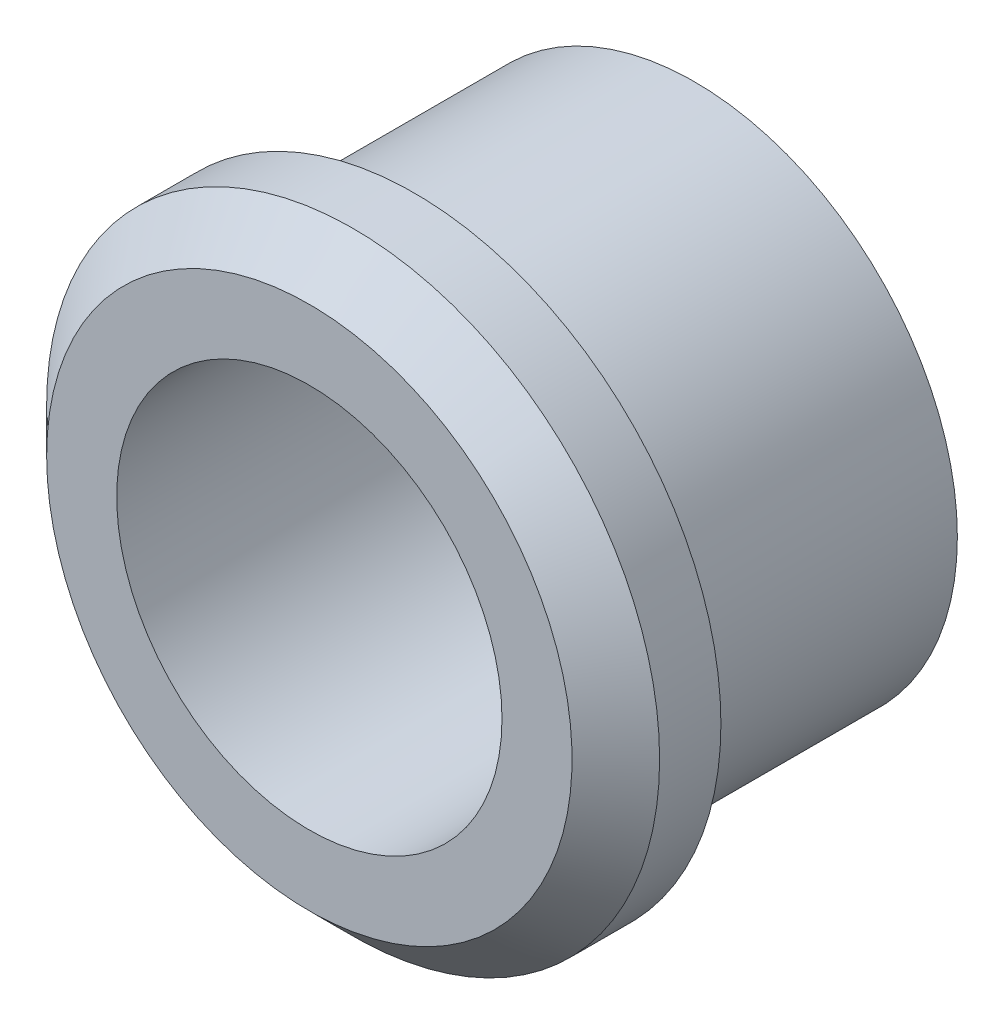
ISO-10303-21;
HEADER;
FILE_DESCRIPTION(('STEP AP214'),'2;1');
FILE_NAME('part.step','',(''),(''),'','','');
FILE_SCHEMA(('AUTOMOTIVE_DESIGN { 1 0 10303 214 1 1 1 1 }'));
ENDSEC;
DATA;
#1=APPLICATION_CONTEXT('core data for automotive mechanical design processes');
#2=APPLICATION_PROTOCOL_DEFINITION('international standard','automotive_design',2000,#1);
#3=PRODUCT_CONTEXT('',#1,'mechanical');
#4=PRODUCT('Part','Part','',(#3));
#5=PRODUCT_RELATED_PRODUCT_CATEGORY('part','',(#4));
#6=PRODUCT_DEFINITION_FORMATION('','',#4);
#7=PRODUCT_DEFINITION_CONTEXT('part definition',#1,'design');
#8=PRODUCT_DEFINITION('design','',#6,#7);
#9=PRODUCT_DEFINITION_SHAPE('','',#8);
#10=(LENGTH_UNIT() NAMED_UNIT(*) SI_UNIT(.MILLI.,.METRE.));
#11=(NAMED_UNIT(*) PLANE_ANGLE_UNIT() SI_UNIT($,.RADIAN.));
#12=(NAMED_UNIT(*) SI_UNIT($,.STERADIAN.) SOLID_ANGLE_UNIT());
#13=UNCERTAINTY_MEASURE_WITH_UNIT(LENGTH_MEASURE(1.E-05),#10,'distance_accuracy_value','');
#14=(GEOMETRIC_REPRESENTATION_CONTEXT(3) GLOBAL_UNCERTAINTY_ASSIGNED_CONTEXT((#13)) GLOBAL_UNIT_ASSIGNED_CONTEXT((#10,
#11,#12)) REPRESENTATION_CONTEXT('',''));
#15=CARTESIAN_POINT('',(0.,0.,0.));
#16=DIRECTION('',(0.,0.,1.));
#17=DIRECTION('',(1.,0.,0.));
#18=AXIS2_PLACEMENT_3D('',#15,#16,#17);
#19=CARTESIAN_POINT('',(0.,0.,11.));
#20=DIRECTION('',(0.,0.,1.));
#21=DIRECTION('',(1.,0.,0.));
#22=AXIS2_PLACEMENT_3D('',#19,#20,#21);
#23=CYLINDRICAL_SURFACE('',#22,17.5);
#24=CARTESIAN_POINT('',(0.,0.,19.4999999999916));
#25=DIRECTION('',(0.,0.,-1.));
#26=DIRECTION('',(-0.479425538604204,0.877582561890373,0.));
#27=AXIS2_PLACEMENT_3D('',#24,#25,#26);
#28=CIRCLE('',#27,17.5000000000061);
#29=CARTESIAN_POINT('',(-8.38994692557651,15.3576948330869,19.4999999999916));
#30=VERTEX_POINT('',#29);
#31=EDGE_CURVE('E30',#30,#30,#28,.F.);
#32=ORIENTED_EDGE('',*,*,#31,.F.);
#33=EDGE_LOOP('',(#32));
#34=FACE_BOUND('',#33,.T.);
#35=CARTESIAN_POINT('',(0.,0.,16.));
#36=DIRECTION('',(0.,0.,1.));
#37=DIRECTION('',(1.,0.,0.));
#38=AXIS2_PLACEMENT_3D('',#35,#36,#37);
#39=CIRCLE('',#38,17.5);
#40=CARTESIAN_POINT('',(17.5,0.,16.));
#41=VERTEX_POINT('',#40);
#42=EDGE_CURVE('E18',#41,#41,#39,.T.);
#43=ORIENTED_EDGE('',*,*,#42,.T.);
#44=EDGE_LOOP('',(#43));
#45=FACE_BOUND('',#44,.T.);
#46=ADVANCED_FACE('F14',(#34,#45),#23,.T.);
#47=CARTESIAN_POINT('',(0.,15.,16.));
#48=DIRECTION('',(0.,0.,1.));
#49=DIRECTION('',(1.,0.,0.));
#50=AXIS2_PLACEMENT_3D('',#47,#48,#49);
#51=PLANE('',#50);
#52=CARTESIAN_POINT('',(0.,0.,16.));
#53=DIRECTION('',(0.,0.,1.));
#54=DIRECTION('',(1.,0.,0.));
#55=AXIS2_PLACEMENT_3D('',#52,#53,#54);
#56=CIRCLE('',#55,15.);
#57=CARTESIAN_POINT('',(15.,0.,16.));
#58=VERTEX_POINT('',#57);
#59=EDGE_CURVE('E36',#58,#58,#56,.F.);
#60=ORIENTED_EDGE('',*,*,#59,.F.);
#61=EDGE_LOOP('',(#60));
#62=FACE_BOUND('',#61,.T.);
#63=ORIENTED_EDGE('',*,*,#42,.F.);
#64=EDGE_LOOP('',(#63));
#65=FACE_BOUND('',#64,.T.);
#66=ADVANCED_FACE('F47',(#62,#65),#51,.F.);
#67=CARTESIAN_POINT('',(0.,0.,19.4999999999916));
#68=DIRECTION('',(0.,0.,-1.));
#69=DIRECTION('',(-1.,0.,0.));
#70=AXIS2_PLACEMENT_3D('',#67,#68,#69);
#71=CONICAL_SURFACE('',#70,17.5000000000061,0.785398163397);
#72=CARTESIAN_POINT('',(0.,0.,21.9999999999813));
#73=DIRECTION('',(0.,0.,-1.));
#74=DIRECTION('',(-1.,0.,0.));
#75=AXIS2_PLACEMENT_3D('',#72,#73,#74);
#76=CIRCLE('',#75,15.0000000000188);
#77=CARTESIAN_POINT('',(-15.0000000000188,0.,21.9999999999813));
#78=VERTEX_POINT('',#77);
#79=EDGE_CURVE('E34',#78,#78,#76,.F.);
#80=ORIENTED_EDGE('',*,*,#79,.F.);
#81=EDGE_LOOP('',(#80));
#82=FACE_BOUND('',#81,.T.);
#83=ORIENTED_EDGE('',*,*,#31,.T.);
#84=EDGE_LOOP('',(#83));
#85=FACE_BOUND('',#84,.T.);
#86=ADVANCED_FACE('F49',(#82,#85),#71,.T.);
#87=CARTESIAN_POINT('',(0.,0.,11.));
#88=DIRECTION('',(0.,0.,1.));
#89=DIRECTION('',(1.,0.,0.));
#90=AXIS2_PLACEMENT_3D('',#87,#88,#89);
#91=CYLINDRICAL_SURFACE('',#90,15.);
#92=ORIENTED_EDGE('',*,*,#59,.T.);
#93=EDGE_LOOP('',(#92));
#94=FACE_BOUND('',#93,.T.);
#95=CARTESIAN_POINT('',(0.,0.,0.));
#96=DIRECTION('',(0.,0.,1.));
#97=DIRECTION('',(1.,0.,0.));
#98=AXIS2_PLACEMENT_3D('',#95,#96,#97);
#99=CIRCLE('',#98,15.);
#100=CARTESIAN_POINT('',(15.,0.,0.));
#101=VERTEX_POINT('',#100);
#102=EDGE_CURVE('E27',#101,#101,#99,.T.);
#103=ORIENTED_EDGE('',*,*,#102,.T.);
#104=EDGE_LOOP('',(#103));
#105=FACE_BOUND('',#104,.T.);
#106=ADVANCED_FACE('F57',(#94,#105),#91,.T.);
#107=CARTESIAN_POINT('',(0.,15.,22.));
#108=DIRECTION('',(0.,0.,1.));
#109=DIRECTION('',(1.,0.,0.));
#110=AXIS2_PLACEMENT_3D('',#107,#108,#109);
#111=PLANE('',#110);
#112=CARTESIAN_POINT('',(0.,0.,22.));
#113=DIRECTION('',(0.,0.,1.));
#114=DIRECTION('',(1.,0.,0.));
#115=AXIS2_PLACEMENT_3D('',#112,#113,#114);
#116=CIRCLE('',#115,11.);
#117=CARTESIAN_POINT('',(11.,0.,22.));
#118=VERTEX_POINT('',#117);
#119=EDGE_CURVE('E22',#118,#118,#116,.F.);
#120=ORIENTED_EDGE('',*,*,#119,.T.);
#121=EDGE_LOOP('',(#120));
#122=FACE_BOUND('',#121,.T.);
#123=ORIENTED_EDGE('',*,*,#79,.T.);
#124=EDGE_LOOP('',(#123));
#125=FACE_BOUND('',#124,.T.);
#126=ADVANCED_FACE('F68',(#122,#125),#111,.T.);
#127=CARTESIAN_POINT('',(0.,11.,0.));
#128=DIRECTION('',(0.,0.,1.));
#129=DIRECTION('',(1.,0.,0.));
#130=AXIS2_PLACEMENT_3D('',#127,#128,#129);
#131=PLANE('',#130);
#132=CARTESIAN_POINT('',(0.,0.,0.));
#133=DIRECTION('',(0.,0.,1.));
#134=DIRECTION('',(1.,0.,0.));
#135=AXIS2_PLACEMENT_3D('',#132,#133,#134);
#136=CIRCLE('',#135,11.);
#137=CARTESIAN_POINT('',(11.,0.,0.));
#138=VERTEX_POINT('',#137);
#139=EDGE_CURVE('E10',#138,#138,#136,.T.);
#140=ORIENTED_EDGE('',*,*,#139,.T.);
#141=EDGE_LOOP('',(#140));
#142=FACE_BOUND('',#141,.T.);
#143=ORIENTED_EDGE('',*,*,#102,.F.);
#144=EDGE_LOOP('',(#143));
#145=FACE_BOUND('',#144,.T.);
#146=ADVANCED_FACE('F63',(#142,#145),#131,.F.);
#147=CARTESIAN_POINT('',(0.,0.,11.));
#148=DIRECTION('',(0.,0.,1.));
#149=DIRECTION('',(1.,0.,0.));
#150=AXIS2_PLACEMENT_3D('',#147,#148,#149);
#151=CYLINDRICAL_SURFACE('',#150,11.);
#152=ORIENTED_EDGE('',*,*,#139,.F.);
#153=EDGE_LOOP('',(#152));
#154=FACE_BOUND('',#153,.T.);
#155=ORIENTED_EDGE('',*,*,#119,.F.);
#156=EDGE_LOOP('',(#155));
#157=FACE_BOUND('',#156,.T.);
#158=ADVANCED_FACE('F16',(#154,#157),#151,.F.);
#159=CLOSED_SHELL('',(#46,#66,#86,#106,#126,#146,#158));
#160=MANIFOLD_SOLID_BREP('B1',#159);
#161=ADVANCED_BREP_SHAPE_REPRESENTATION('',(#18,#160),#14);
#162=SHAPE_DEFINITION_REPRESENTATION(#9,#161);
ENDSEC;
END-ISO-10303-21;
